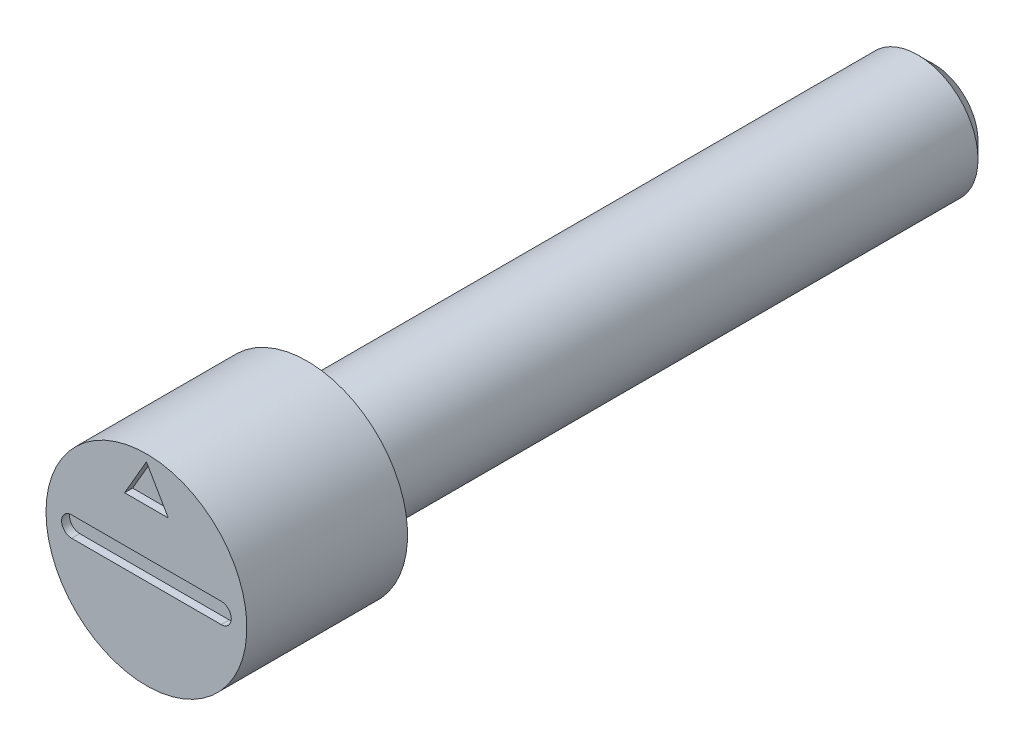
ISO-10303-21;
HEADER;
FILE_DESCRIPTION(('STEP AP214'),'2;1');
FILE_NAME('part.step','',(''),(''),'','','');
FILE_SCHEMA(('AUTOMOTIVE_DESIGN { 1 0 10303 214 1 1 1 1 }'));
ENDSEC;
DATA;
#1=APPLICATION_CONTEXT('core data for automotive mechanical design processes');
#2=APPLICATION_PROTOCOL_DEFINITION('international standard','automotive_design',2000,#1);
#3=PRODUCT_CONTEXT('',#1,'mechanical');
#4=PRODUCT('Part','Part','',(#3));
#5=PRODUCT_RELATED_PRODUCT_CATEGORY('part','',(#4));
#6=PRODUCT_DEFINITION_FORMATION('','',#4);
#7=PRODUCT_DEFINITION_CONTEXT('part definition',#1,'design');
#8=PRODUCT_DEFINITION('design','',#6,#7);
#9=PRODUCT_DEFINITION_SHAPE('','',#8);
#10=(LENGTH_UNIT() NAMED_UNIT(*) SI_UNIT(.MILLI.,.METRE.));
#11=(NAMED_UNIT(*) PLANE_ANGLE_UNIT() SI_UNIT($,.RADIAN.));
#12=(NAMED_UNIT(*) SI_UNIT($,.STERADIAN.) SOLID_ANGLE_UNIT());
#13=UNCERTAINTY_MEASURE_WITH_UNIT(LENGTH_MEASURE(1.E-05),#10,'distance_accuracy_value','');
#14=(GEOMETRIC_REPRESENTATION_CONTEXT(3) GLOBAL_UNCERTAINTY_ASSIGNED_CONTEXT((#13)) GLOBAL_UNIT_ASSIGNED_CONTEXT((#10,
#11,#12)) REPRESENTATION_CONTEXT('',''));
#15=CARTESIAN_POINT('',(0.,0.,0.));
#16=DIRECTION('',(0.,0.,1.));
#17=DIRECTION('',(1.,0.,0.));
#18=AXIS2_PLACEMENT_3D('',#15,#16,#17);
#19=CARTESIAN_POINT('',(0.62499875,0.,0.));
#20=DIRECTION('',(0.,0.,1.));
#21=DIRECTION('',(1.,0.,0.));
#22=AXIS2_PLACEMENT_3D('',#19,#20,#21);
#23=PLANE('',#22);
#24=CARTESIAN_POINT('',(-0.93,0.,0.));
#25=DIRECTION('',(0.,0.,1.));
#26=DIRECTION('',(1.,0.,0.));
#27=AXIS2_PLACEMENT_3D('',#24,#25,#26);
#28=CIRCLE('',#27,0.126);
#29=CARTESIAN_POINT('',(-0.93,0.126,0.));
#30=VERTEX_POINT('',#29);
#31=CARTESIAN_POINT('',(-0.93,-0.126,0.));
#32=VERTEX_POINT('',#31);
#33=EDGE_CURVE('E54',#30,#32,#28,.T.);
#34=ORIENTED_EDGE('',*,*,#33,.F.);
#35=DIRECTION('',(-1.,0.,0.));
#36=VECTOR('',#35,1.);
#37=CARTESIAN_POINT('',(-0.93,0.126,0.));
#38=LINE('',#37,#36);
#39=CARTESIAN_POINT('',(0.93,0.126,0.));
#40=VERTEX_POINT('',#39);
#41=EDGE_CURVE('E118',#40,#30,#38,.T.);
#42=ORIENTED_EDGE('',*,*,#41,.F.);
#43=CARTESIAN_POINT('',(0.93,0.,0.));
#44=DIRECTION('',(0.,0.,1.));
#45=DIRECTION('',(1.,0.,0.));
#46=AXIS2_PLACEMENT_3D('',#43,#44,#45);
#47=CIRCLE('',#46,0.126);
#48=CARTESIAN_POINT('',(0.93,-0.126,0.));
#49=VERTEX_POINT('',#48);
#50=EDGE_CURVE('E121',#49,#40,#47,.T.);
#51=ORIENTED_EDGE('',*,*,#50,.F.);
#52=DIRECTION('',(1.,0.,0.));
#53=VECTOR('',#52,1.);
#54=CARTESIAN_POINT('',(-0.93,-0.126,0.));
#55=LINE('',#54,#53);
#56=EDGE_CURVE('E127',#32,#49,#55,.T.);
#57=ORIENTED_EDGE('',*,*,#56,.F.);
#58=EDGE_LOOP('',(#34,#42,#51,#57));
#59=FACE_BOUND('',#58,.T.);
#60=DIRECTION('',(-0.499999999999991,0.866025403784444,0.));
#61=VECTOR('',#60,1.);
#62=CARTESIAN_POINT('',(0.271499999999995,0.6939,0.));
#63=LINE('',#62,#61);
#64=CARTESIAN_POINT('',(0.271499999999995,0.6939,0.));
#65=VERTEX_POINT('',#64);
#66=CARTESIAN_POINT('',(0.,1.16415179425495,0.));
#67=VERTEX_POINT('',#66);
#68=EDGE_CURVE('E62',#65,#67,#63,.T.);
#69=ORIENTED_EDGE('',*,*,#68,.F.);
#70=DIRECTION('',(1.,0.,0.));
#71=VECTOR('',#70,1.);
#72=CARTESIAN_POINT('',(-0.271500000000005,0.6939,0.));
#73=LINE('',#72,#71);
#74=CARTESIAN_POINT('',(-0.271500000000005,0.6939,0.));
#75=VERTEX_POINT('',#74);
#76=EDGE_CURVE('E140',#75,#65,#73,.T.);
#77=ORIENTED_EDGE('',*,*,#76,.F.);
#78=DIRECTION('',(-0.500000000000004,-0.866025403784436,0.));
#79=VECTOR('',#78,1.);
#80=CARTESIAN_POINT('',(0.,1.16415179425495,0.));
#81=LINE('',#80,#79);
#82=EDGE_CURVE('E148',#67,#75,#81,.T.);
#83=ORIENTED_EDGE('',*,*,#82,.F.);
#84=EDGE_LOOP('',(#69,#77,#83));
#85=FACE_BOUND('',#84,.T.);
#86=CARTESIAN_POINT('',(0.,0.,0.));
#87=DIRECTION('',(0.,0.,-1.));
#88=DIRECTION('',(-1.,0.,0.));
#89=AXIS2_PLACEMENT_3D('',#86,#87,#88);
#90=CIRCLE('',#89,1.2499975);
#91=CARTESIAN_POINT('',(-1.2499975,0.,0.));
#92=VERTEX_POINT('',#91);
#93=EDGE_CURVE('E155',#92,#92,#90,.T.);
#94=ORIENTED_EDGE('',*,*,#93,.F.);
#95=EDGE_LOOP('',(#94));
#96=FACE_BOUND('',#95,.T.);
#97=ADVANCED_FACE('F38',(#59,#85,#96),#23,.T.);
#98=CARTESIAN_POINT('',(0.,0.,-0.999998));
#99=DIRECTION('',(0.,0.,-1.));
#100=DIRECTION('',(-1.,0.,0.));
#101=AXIS2_PLACEMENT_3D('',#98,#99,#100);
#102=CYLINDRICAL_SURFACE('',#101,1.2499975);
#103=ORIENTED_EDGE('',*,*,#93,.T.);
#104=EDGE_LOOP('',(#103));
#105=FACE_BOUND('',#104,.T.);
#106=CARTESIAN_POINT('',(0.,0.,-1.999996));
#107=DIRECTION('',(0.,0.,-1.));
#108=DIRECTION('',(-1.,0.,0.));
#109=AXIS2_PLACEMENT_3D('',#106,#107,#108);
#110=CIRCLE('',#109,1.2499975);
#111=CARTESIAN_POINT('',(-1.2499975,0.,-1.999996));
#112=VERTEX_POINT('',#111);
#113=EDGE_CURVE('E162',#112,#112,#110,.T.);
#114=ORIENTED_EDGE('',*,*,#113,.F.);
#115=EDGE_LOOP('',(#114));
#116=FACE_BOUND('',#115,.T.);
#117=ADVANCED_FACE('F190',(#105,#116),#102,.T.);
#118=CARTESIAN_POINT('',(0.999998,0.,-1.999996));
#119=DIRECTION('',(0.,0.,-1.));
#120=DIRECTION('',(-1.,0.,0.));
#121=AXIS2_PLACEMENT_3D('',#118,#119,#120);
#122=PLANE('',#121);
#123=CARTESIAN_POINT('',(0.,0.,-1.999996));
#124=DIRECTION('',(0.,0.,-1.));
#125=DIRECTION('',(-1.,0.,0.));
#126=AXIS2_PLACEMENT_3D('',#123,#124,#125);
#127=CIRCLE('',#126,0.7499985);
#128=CARTESIAN_POINT('',(-0.749998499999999,0.,-1.999996));
#129=VERTEX_POINT('',#128);
#130=EDGE_CURVE('E159',#129,#129,#127,.T.);
#131=ORIENTED_EDGE('',*,*,#130,.F.);
#132=EDGE_LOOP('',(#131));
#133=FACE_BOUND('',#132,.T.);
#134=ORIENTED_EDGE('',*,*,#113,.T.);
#135=EDGE_LOOP('',(#134));
#136=FACE_BOUND('',#135,.T.);
#137=ADVANCED_FACE('F181',(#133,#136),#122,.T.);
#138=CARTESIAN_POINT('',(0.,0.,-7.499985));
#139=DIRECTION('',(0.,0.,-1.));
#140=DIRECTION('',(-1.,0.,0.));
#141=AXIS2_PLACEMENT_3D('',#138,#139,#140);
#142=CYLINDRICAL_SURFACE('',#141,0.7499985);
#143=CARTESIAN_POINT('',(0.,0.,-9.6));
#144=DIRECTION('',(0.,0.,1.));
#145=DIRECTION('',(1.,0.,0.));
#146=AXIS2_PLACEMENT_3D('',#143,#144,#145);
#147=CIRCLE('',#146,0.7499985);
#148=CARTESIAN_POINT('',(0.749998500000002,0.,-9.6));
#149=VERTEX_POINT('',#148);
#150=EDGE_CURVE('E11',#149,#149,#147,.T.);
#151=ORIENTED_EDGE('',*,*,#150,.T.);
#152=EDGE_LOOP('',(#151));
#153=FACE_BOUND('',#152,.T.);
#154=ORIENTED_EDGE('',*,*,#130,.T.);
#155=EDGE_LOOP('',(#154));
#156=FACE_BOUND('',#155,.T.);
#157=ADVANCED_FACE('F178',(#153,#156),#142,.T.);
#158=CARTESIAN_POINT('',(0.271499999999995,0.6939,-0.1));
#159=DIRECTION('',(0.866025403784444,0.499999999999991,0.));
#160=DIRECTION('',(-0.499999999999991,0.866025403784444,0.));
#161=AXIS2_PLACEMENT_3D('',#158,#159,#160);
#162=PLANE('',#161);
#163=ORIENTED_EDGE('',*,*,#68,.T.);
#164=DIRECTION('',(0.,0.,1.));
#165=VECTOR('',#164,1.);
#166=CARTESIAN_POINT('',(0.,1.16415179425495,-0.1));
#167=LINE('',#166,#165);
#168=CARTESIAN_POINT('',(0.,1.16415179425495,-0.1));
#169=VERTEX_POINT('',#168);
#170=EDGE_CURVE('E146',#169,#67,#167,.T.);
#171=ORIENTED_EDGE('',*,*,#170,.F.);
#172=DIRECTION('',(-0.499999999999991,0.866025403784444,0.));
#173=VECTOR('',#172,1.);
#174=CARTESIAN_POINT('',(0.271499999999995,0.6939,-0.1));
#175=LINE('',#174,#173);
#176=CARTESIAN_POINT('',(0.271499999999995,0.6939,-0.1));
#177=VERTEX_POINT('',#176);
#178=EDGE_CURVE('E136',#177,#169,#175,.T.);
#179=ORIENTED_EDGE('',*,*,#178,.F.);
#180=DIRECTION('',(0.,0.,1.));
#181=VECTOR('',#180,1.);
#182=CARTESIAN_POINT('',(0.271499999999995,0.6939,-0.1));
#183=LINE('',#182,#181);
#184=EDGE_CURVE('E153',#177,#65,#183,.T.);
#185=ORIENTED_EDGE('',*,*,#184,.T.);
#186=EDGE_LOOP('',(#163,#171,#179,#185));
#187=FACE_BOUND('',#186,.T.);
#188=ADVANCED_FACE('F180',(#187),#162,.F.);
#189=CARTESIAN_POINT('',(-0.271500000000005,0.6939,-0.1));
#190=DIRECTION('',(0.,-1.,0.));
#191=DIRECTION('',(1.,0.,0.));
#192=AXIS2_PLACEMENT_3D('',#189,#190,#191);
#193=PLANE('',#192);
#194=ORIENTED_EDGE('',*,*,#76,.T.);
#195=ORIENTED_EDGE('',*,*,#184,.F.);
#196=DIRECTION('',(1.,0.,0.));
#197=VECTOR('',#196,1.);
#198=CARTESIAN_POINT('',(-0.271500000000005,0.6939,-0.1));
#199=LINE('',#198,#197);
#200=CARTESIAN_POINT('',(-0.271500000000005,0.6939,-0.1));
#201=VERTEX_POINT('',#200);
#202=EDGE_CURVE('E143',#201,#177,#199,.T.);
#203=ORIENTED_EDGE('',*,*,#202,.F.);
#204=DIRECTION('',(0.,0.,1.));
#205=VECTOR('',#204,1.);
#206=CARTESIAN_POINT('',(-0.271500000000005,0.6939,-0.1));
#207=LINE('',#206,#205);
#208=EDGE_CURVE('E156',#201,#75,#207,.T.);
#209=ORIENTED_EDGE('',*,*,#208,.T.);
#210=EDGE_LOOP('',(#194,#195,#203,#209));
#211=FACE_BOUND('',#210,.T.);
#212=ADVANCED_FACE('F188',(#211),#193,.F.);
#213=CARTESIAN_POINT('',(0.,1.16415179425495,-0.1));
#214=DIRECTION('',(-0.866025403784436,0.500000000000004,0.));
#215=DIRECTION('',(-0.500000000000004,-0.866025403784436,0.));
#216=AXIS2_PLACEMENT_3D('',#213,#214,#215);
#217=PLANE('',#216);
#218=ORIENTED_EDGE('',*,*,#82,.T.);
#219=ORIENTED_EDGE('',*,*,#208,.F.);
#220=DIRECTION('',(-0.500000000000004,-0.866025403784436,0.));
#221=VECTOR('',#220,1.);
#222=CARTESIAN_POINT('',(0.,1.16415179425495,-0.1));
#223=LINE('',#222,#221);
#224=EDGE_CURVE('E139',#169,#201,#223,.T.);
#225=ORIENTED_EDGE('',*,*,#224,.F.);
#226=ORIENTED_EDGE('',*,*,#170,.T.);
#227=EDGE_LOOP('',(#218,#219,#225,#226));
#228=FACE_BOUND('',#227,.T.);
#229=ADVANCED_FACE('F212',(#228),#217,.F.);
#230=CARTESIAN_POINT('',(0.,0.,-0.1));
#231=DIRECTION('',(0.,0.,1.));
#232=DIRECTION('',(1.,0.,0.));
#233=AXIS2_PLACEMENT_3D('',#230,#231,#232);
#234=PLANE('',#233);
#235=ORIENTED_EDGE('',*,*,#178,.T.);
#236=ORIENTED_EDGE('',*,*,#224,.T.);
#237=ORIENTED_EDGE('',*,*,#202,.T.);
#238=EDGE_LOOP('',(#235,#236,#237));
#239=FACE_BOUND('',#238,.T.);
#240=ADVANCED_FACE('F217',(#239),#234,.T.);
#241=CARTESIAN_POINT('',(-0.93,0.,-0.1));
#242=DIRECTION('',(0.,0.,1.));
#243=DIRECTION('',(1.,0.,0.));
#244=AXIS2_PLACEMENT_3D('',#241,#242,#243);
#245=CYLINDRICAL_SURFACE('',#244,0.126);
#246=ORIENTED_EDGE('',*,*,#33,.T.);
#247=DIRECTION('',(0.,0.,1.));
#248=VECTOR('',#247,1.);
#249=CARTESIAN_POINT('',(-0.93,-0.126,-0.1));
#250=LINE('',#249,#248);
#251=CARTESIAN_POINT('',(-0.93,-0.126,-0.1));
#252=VERTEX_POINT('',#251);
#253=EDGE_CURVE('E96',#252,#32,#250,.T.);
#254=ORIENTED_EDGE('',*,*,#253,.F.);
#255=CARTESIAN_POINT('',(-0.93,0.,-0.1));
#256=DIRECTION('',(0.,0.,1.));
#257=DIRECTION('',(1.,0.,0.));
#258=AXIS2_PLACEMENT_3D('',#255,#256,#257);
#259=CIRCLE('',#258,0.126);
#260=CARTESIAN_POINT('',(-0.93,0.126,-0.1));
#261=VERTEX_POINT('',#260);
#262=EDGE_CURVE('E100',#261,#252,#259,.T.);
#263=ORIENTED_EDGE('',*,*,#262,.F.);
#264=DIRECTION('',(0.,0.,1.));
#265=VECTOR('',#264,1.);
#266=CARTESIAN_POINT('',(-0.93,0.126,-0.1));
#267=LINE('',#266,#265);
#268=EDGE_CURVE('E131',#261,#30,#267,.T.);
#269=ORIENTED_EDGE('',*,*,#268,.T.);
#270=EDGE_LOOP('',(#246,#254,#263,#269));
#271=FACE_BOUND('',#270,.T.);
#272=ADVANCED_FACE('F98',(#271),#245,.F.);
#273=CARTESIAN_POINT('',(-0.93,0.126,-0.1));
#274=DIRECTION('',(0.,1.,0.));
#275=DIRECTION('',(0.,0.,1.));
#276=AXIS2_PLACEMENT_3D('',#273,#274,#275);
#277=PLANE('',#276);
#278=ORIENTED_EDGE('',*,*,#41,.T.);
#279=ORIENTED_EDGE('',*,*,#268,.F.);
#280=DIRECTION('',(-1.,0.,0.));
#281=VECTOR('',#280,1.);
#282=CARTESIAN_POINT('',(-0.93,0.126,-0.1));
#283=LINE('',#282,#281);
#284=CARTESIAN_POINT('',(0.93,0.126,-0.1));
#285=VERTEX_POINT('',#284);
#286=EDGE_CURVE('E106',#285,#261,#283,.T.);
#287=ORIENTED_EDGE('',*,*,#286,.F.);
#288=DIRECTION('',(0.,0.,1.));
#289=VECTOR('',#288,1.);
#290=CARTESIAN_POINT('',(0.93,0.126,-0.1));
#291=LINE('',#290,#289);
#292=EDGE_CURVE('E133',#285,#40,#291,.T.);
#293=ORIENTED_EDGE('',*,*,#292,.T.);
#294=EDGE_LOOP('',(#278,#279,#287,#293));
#295=FACE_BOUND('',#294,.T.);
#296=ADVANCED_FACE('F229',(#295),#277,.F.);
#297=CARTESIAN_POINT('',(0.93,0.,-0.1));
#298=DIRECTION('',(0.,0.,1.));
#299=DIRECTION('',(1.,0.,0.));
#300=AXIS2_PLACEMENT_3D('',#297,#298,#299);
#301=CYLINDRICAL_SURFACE('',#300,0.126);
#302=ORIENTED_EDGE('',*,*,#50,.T.);
#303=ORIENTED_EDGE('',*,*,#292,.F.);
#304=CARTESIAN_POINT('',(0.93,0.,-0.1));
#305=DIRECTION('',(0.,0.,1.));
#306=DIRECTION('',(1.,0.,0.));
#307=AXIS2_PLACEMENT_3D('',#304,#305,#306);
#308=CIRCLE('',#307,0.126);
#309=CARTESIAN_POINT('',(0.93,-0.126,-0.1));
#310=VERTEX_POINT('',#309);
#311=EDGE_CURVE('E114',#310,#285,#308,.T.);
#312=ORIENTED_EDGE('',*,*,#311,.F.);
#313=DIRECTION('',(0.,0.,1.));
#314=VECTOR('',#313,1.);
#315=CARTESIAN_POINT('',(0.93,-0.126,-0.1));
#316=LINE('',#315,#314);
#317=EDGE_CURVE('E105',#310,#49,#316,.T.);
#318=ORIENTED_EDGE('',*,*,#317,.T.);
#319=EDGE_LOOP('',(#302,#303,#312,#318));
#320=FACE_BOUND('',#319,.T.);
#321=ADVANCED_FACE('F232',(#320),#301,.F.);
#322=CARTESIAN_POINT('',(-0.93,-0.126,-0.1));
#323=DIRECTION('',(0.,-1.,0.));
#324=DIRECTION('',(0.,0.,-1.));
#325=AXIS2_PLACEMENT_3D('',#322,#323,#324);
#326=PLANE('',#325);
#327=ORIENTED_EDGE('',*,*,#56,.T.);
#328=ORIENTED_EDGE('',*,*,#317,.F.);
#329=DIRECTION('',(1.,0.,0.));
#330=VECTOR('',#329,1.);
#331=CARTESIAN_POINT('',(-0.93,-0.126,-0.1));
#332=LINE('',#331,#330);
#333=EDGE_CURVE('E109',#252,#310,#332,.T.);
#334=ORIENTED_EDGE('',*,*,#333,.F.);
#335=ORIENTED_EDGE('',*,*,#253,.T.);
#336=EDGE_LOOP('',(#327,#328,#334,#335));
#337=FACE_BOUND('',#336,.T.);
#338=ADVANCED_FACE('F110',(#337),#326,.F.);
#339=CARTESIAN_POINT('',(-0.93,0.,-0.1));
#340=DIRECTION('',(0.,0.,1.));
#341=DIRECTION('',(1.,0.,0.));
#342=AXIS2_PLACEMENT_3D('',#339,#340,#341);
#343=PLANE('',#342);
#344=ORIENTED_EDGE('',*,*,#262,.T.);
#345=ORIENTED_EDGE('',*,*,#333,.T.);
#346=ORIENTED_EDGE('',*,*,#311,.T.);
#347=ORIENTED_EDGE('',*,*,#286,.T.);
#348=EDGE_LOOP('',(#344,#345,#346,#347));
#349=FACE_BOUND('',#348,.T.);
#350=ADVANCED_FACE('F116',(#349),#343,.T.);
#351=CARTESIAN_POINT('',(-0.749998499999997,-1.2499975,-9.8));
#352=DIRECTION('',(0.,0.,1.));
#353=DIRECTION('',(1.,0.,0.));
#354=AXIS2_PLACEMENT_3D('',#351,#352,#353);
#355=PLANE('',#354);
#356=CARTESIAN_POINT('',(0.,0.,-9.8));
#357=DIRECTION('',(0.,0.,1.));
#358=DIRECTION('',(1.,0.,0.));
#359=AXIS2_PLACEMENT_3D('',#356,#357,#358);
#360=CIRCLE('',#359,0.549998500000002);
#361=CARTESIAN_POINT('',(0.549998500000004,0.,-9.8));
#362=VERTEX_POINT('',#361);
#363=EDGE_CURVE('E47',#362,#362,#360,.F.);
#364=ORIENTED_EDGE('',*,*,#363,.T.);
#365=EDGE_LOOP('',(#364));
#366=FACE_BOUND('',#365,.T.);
#367=ADVANCED_FACE('F169',(#366),#355,.F.);
#368=CARTESIAN_POINT('',(0.,0.,-9.8));
#369=DIRECTION('',(0.,0.,1.));
#370=DIRECTION('',(1.,0.,0.));
#371=AXIS2_PLACEMENT_3D('',#368,#369,#370);
#372=CONICAL_SURFACE('',#371,0.549998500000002,0.785398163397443);
#373=ORIENTED_EDGE('',*,*,#150,.F.);
#374=EDGE_LOOP('',(#373));
#375=FACE_BOUND('',#374,.T.);
#376=ORIENTED_EDGE('',*,*,#363,.F.);
#377=EDGE_LOOP('',(#376));
#378=FACE_BOUND('',#377,.T.);
#379=ADVANCED_FACE('F41',(#375,#378),#372,.T.);
#380=CLOSED_SHELL('',(#97,#117,#137,#157,#188,#212,#229,#240,#272,#296,#321,#338,#350,#367,#379));
#381=MANIFOLD_SOLID_BREP('B2',#380);
#382=ADVANCED_BREP_SHAPE_REPRESENTATION('',(#18,#381),#14);
#383=SHAPE_DEFINITION_REPRESENTATION(#9,#382);
ENDSEC;
END-ISO-10303-21;
